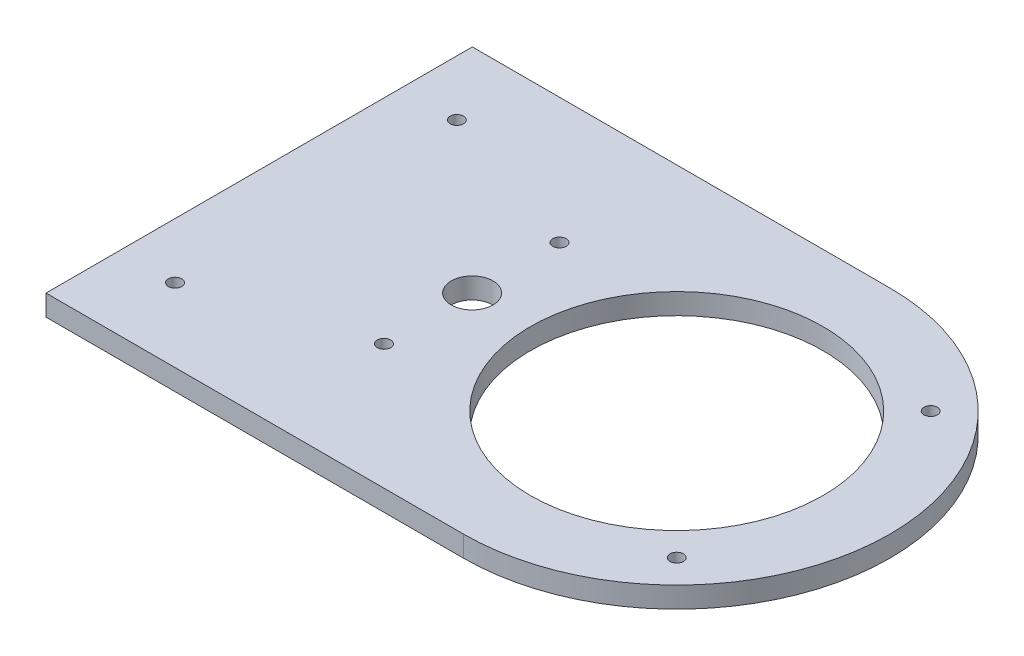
ISO-10303-21;
HEADER;
FILE_DESCRIPTION(('STEP AP214'),'2;1');
FILE_NAME('part.step','',(''),(''),'','','');
FILE_SCHEMA(('AUTOMOTIVE_DESIGN { 1 0 10303 214 1 1 1 1 }'));
ENDSEC;
DATA;
#1=APPLICATION_CONTEXT('core data for automotive mechanical design processes');
#2=APPLICATION_PROTOCOL_DEFINITION('international standard','automotive_design',2000,#1);
#3=PRODUCT_CONTEXT('',#1,'mechanical');
#4=PRODUCT('Part','Part','',(#3));
#5=PRODUCT_RELATED_PRODUCT_CATEGORY('part','',(#4));
#6=PRODUCT_DEFINITION_FORMATION('','',#4);
#7=PRODUCT_DEFINITION_CONTEXT('part definition',#1,'design');
#8=PRODUCT_DEFINITION('design','',#6,#7);
#9=PRODUCT_DEFINITION_SHAPE('','',#8);
#10=(LENGTH_UNIT() NAMED_UNIT(*) SI_UNIT(.MILLI.,.METRE.));
#11=(NAMED_UNIT(*) PLANE_ANGLE_UNIT() SI_UNIT($,.RADIAN.));
#12=(NAMED_UNIT(*) SI_UNIT($,.STERADIAN.) SOLID_ANGLE_UNIT());
#13=UNCERTAINTY_MEASURE_WITH_UNIT(LENGTH_MEASURE(1.E-05),#10,'distance_accuracy_value','');
#14=(GEOMETRIC_REPRESENTATION_CONTEXT(3) GLOBAL_UNCERTAINTY_ASSIGNED_CONTEXT((#13)) GLOBAL_UNIT_ASSIGNED_CONTEXT((#10,
#11,#12)) REPRESENTATION_CONTEXT('',''));
#15=CARTESIAN_POINT('',(0.,0.,0.));
#16=DIRECTION('',(0.,0.,1.));
#17=DIRECTION('',(1.,0.,0.));
#18=AXIS2_PLACEMENT_3D('',#15,#16,#17);
#19=CARTESIAN_POINT('',(-100.,5.,51.05));
#20=DIRECTION('',(0.,0.,-1.));
#21=DIRECTION('',(-1.,0.,0.));
#22=AXIS2_PLACEMENT_3D('',#19,#20,#21);
#23=PLANE('',#22);
#24=DIRECTION('',(0.,1.,0.));
#25=VECTOR('',#24,1.);
#26=CARTESIAN_POINT('',(0.,0.,51.05));
#27=LINE('',#26,#25);
#28=CARTESIAN_POINT('',(0.,0.,51.05));
#29=VERTEX_POINT('',#28);
#30=CARTESIAN_POINT('',(0.,5.,51.05));
#31=VERTEX_POINT('',#30);
#32=EDGE_CURVE('E152',#29,#31,#27,.T.);
#33=ORIENTED_EDGE('',*,*,#32,.T.);
#34=DIRECTION('',(1.,0.,0.));
#35=VECTOR('',#34,1.);
#36=CARTESIAN_POINT('',(-100.,5.,51.05));
#37=LINE('',#36,#35);
#38=CARTESIAN_POINT('',(-100.,5.,51.05));
#39=VERTEX_POINT('',#38);
#40=EDGE_CURVE('E92',#39,#31,#37,.T.);
#41=ORIENTED_EDGE('',*,*,#40,.F.);
#42=DIRECTION('',(0.,-1.,0.));
#43=VECTOR('',#42,1.);
#44=CARTESIAN_POINT('',(-100.,5.,51.05));
#45=LINE('',#44,#43);
#46=CARTESIAN_POINT('',(-100.,0.,51.05));
#47=VERTEX_POINT('',#46);
#48=EDGE_CURVE('E49',#39,#47,#45,.T.);
#49=ORIENTED_EDGE('',*,*,#48,.T.);
#50=DIRECTION('',(1.,0.,0.));
#51=VECTOR('',#50,1.);
#52=CARTESIAN_POINT('',(-100.,0.,51.05));
#53=LINE('',#52,#51);
#54=EDGE_CURVE('E86',#47,#29,#53,.T.);
#55=ORIENTED_EDGE('',*,*,#54,.T.);
#56=EDGE_LOOP('',(#33,#41,#49,#55));
#57=FACE_BOUND('',#56,.T.);
#58=ADVANCED_FACE('F40',(#57),#23,.F.);
#59=CARTESIAN_POINT('',(0.,5.,0.));
#60=DIRECTION('',(0.,-1.,0.));
#61=DIRECTION('',(0.,0.,-1.));
#62=AXIS2_PLACEMENT_3D('',#59,#60,#61);
#63=PLANE('',#62);
#64=CARTESIAN_POINT('',(-86.7,5.,-34.05));
#65=DIRECTION('',(0.,-1.,0.));
#66=DIRECTION('',(0.,0.,-1.));
#67=AXIS2_PLACEMENT_3D('',#64,#65,#66);
#68=CIRCLE('',#67,1.6);
#69=CARTESIAN_POINT('',(-86.7,5.,-35.65));
#70=VERTEX_POINT('',#69);
#71=EDGE_CURVE('E197',#70,#70,#68,.T.);
#72=ORIENTED_EDGE('',*,*,#71,.T.);
#73=EDGE_LOOP('',(#72));
#74=FACE_BOUND('',#73,.T.);
#75=CARTESIAN_POINT('',(-86.7,5.,33.45));
#76=DIRECTION('',(0.,-1.,0.));
#77=DIRECTION('',(0.,0.,-1.));
#78=AXIS2_PLACEMENT_3D('',#75,#76,#77);
#79=CIRCLE('',#78,1.6);
#80=CARTESIAN_POINT('',(-86.7,5.,31.85));
#81=VERTEX_POINT('',#80);
#82=EDGE_CURVE('E185',#81,#81,#79,.T.);
#83=ORIENTED_EDGE('',*,*,#82,.T.);
#84=EDGE_LOOP('',(#83));
#85=FACE_BOUND('',#84,.T.);
#86=CARTESIAN_POINT('',(-49.,5.,-20.91));
#87=DIRECTION('',(0.,-1.,0.));
#88=DIRECTION('',(0.,0.,-1.));
#89=AXIS2_PLACEMENT_3D('',#86,#87,#88);
#90=CIRCLE('',#89,1.6);
#91=CARTESIAN_POINT('',(-49.,5.,-22.51));
#92=VERTEX_POINT('',#91);
#93=EDGE_CURVE('E173',#92,#92,#90,.T.);
#94=ORIENTED_EDGE('',*,*,#93,.T.);
#95=EDGE_LOOP('',(#94));
#96=FACE_BOUND('',#95,.T.);
#97=CARTESIAN_POINT('',(-49.,5.,21.11));
#98=DIRECTION('',(0.,-1.,0.));
#99=DIRECTION('',(0.,0.,-1.));
#100=AXIS2_PLACEMENT_3D('',#97,#98,#99);
#101=CIRCLE('',#100,1.6);
#102=CARTESIAN_POINT('',(-49.,5.,19.51));
#103=VERTEX_POINT('',#102);
#104=EDGE_CURVE('E159',#103,#103,#101,.T.);
#105=ORIENTED_EDGE('',*,*,#104,.T.);
#106=EDGE_LOOP('',(#105));
#107=FACE_BOUND('',#106,.T.);
#108=CARTESIAN_POINT('',(30.4055915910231,5.,30.4055915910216));
#109=DIRECTION('',(0.,-1.,0.));
#110=DIRECTION('',(0.,0.,-1.));
#111=AXIS2_PLACEMENT_3D('',#108,#109,#110);
#112=CIRCLE('',#111,1.6);
#113=CARTESIAN_POINT('',(30.4055915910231,5.,28.8055915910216));
#114=VERTEX_POINT('',#113);
#115=EDGE_CURVE('E139',#114,#114,#112,.T.);
#116=ORIENTED_EDGE('',*,*,#115,.T.);
#117=EDGE_LOOP('',(#116));
#118=FACE_BOUND('',#117,.T.);
#119=CARTESIAN_POINT('',(30.4055915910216,5.,-30.4055915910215));
#120=DIRECTION('',(0.,-1.,0.));
#121=DIRECTION('',(0.,0.,-1.));
#122=AXIS2_PLACEMENT_3D('',#119,#120,#121);
#123=CIRCLE('',#122,1.6);
#124=CARTESIAN_POINT('',(30.4055915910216,5.,-32.0055915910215));
#125=VERTEX_POINT('',#124);
#126=EDGE_CURVE('E124',#125,#125,#123,.T.);
#127=ORIENTED_EDGE('',*,*,#126,.T.);
#128=EDGE_LOOP('',(#127));
#129=FACE_BOUND('',#128,.T.);
#130=ORIENTED_EDGE('',*,*,#40,.T.);
#131=CARTESIAN_POINT('',(0.,5.,0.));
#132=DIRECTION('',(0.,-1.,0.));
#133=DIRECTION('',(0.,0.,1.));
#134=AXIS2_PLACEMENT_3D('',#131,#132,#133);
#135=CIRCLE('',#134,51.05);
#136=CARTESIAN_POINT('',(0.,5.,-51.05));
#137=VERTEX_POINT('',#136);
#138=EDGE_CURVE('E56',#137,#31,#135,.T.);
#139=ORIENTED_EDGE('',*,*,#138,.F.);
#140=DIRECTION('',(-1.,0.,0.));
#141=VECTOR('',#140,1.);
#142=CARTESIAN_POINT('',(-100.,5.,-51.05));
#143=LINE('',#142,#141);
#144=CARTESIAN_POINT('',(-100.,5.,-51.05));
#145=VERTEX_POINT('',#144);
#146=EDGE_CURVE('E100',#137,#145,#143,.T.);
#147=ORIENTED_EDGE('',*,*,#146,.T.);
#148=DIRECTION('',(0.,0.,1.));
#149=VECTOR('',#148,1.);
#150=CARTESIAN_POINT('',(-100.,5.,51.05));
#151=LINE('',#150,#149);
#152=EDGE_CURVE('E65',#145,#39,#151,.T.);
#153=ORIENTED_EDGE('',*,*,#152,.T.);
#154=EDGE_LOOP('',(#130,#139,#147,#153));
#155=FACE_BOUND('',#154,.T.);
#156=CARTESIAN_POINT('',(0.,5.,0.));
#157=DIRECTION('',(0.,1.,0.));
#158=DIRECTION('',(0.,0.,1.));
#159=AXIS2_PLACEMENT_3D('',#156,#157,#158);
#160=CIRCLE('',#159,35.05);
#161=CARTESIAN_POINT('',(0.,5.,35.05));
#162=VERTEX_POINT('',#161);
#163=EDGE_CURVE('E107',#162,#162,#160,.T.);
#164=ORIENTED_EDGE('',*,*,#163,.F.);
#165=EDGE_LOOP('',(#164));
#166=FACE_BOUND('',#165,.T.);
#167=CARTESIAN_POINT('',(-49.,5.,0.));
#168=DIRECTION('',(0.,1.,0.));
#169=DIRECTION('',(0.,0.,1.));
#170=AXIS2_PLACEMENT_3D('',#167,#168,#169);
#171=CIRCLE('',#170,5.);
#172=CARTESIAN_POINT('',(-49.,5.,5.));
#173=VERTEX_POINT('',#172);
#174=EDGE_CURVE('E116',#173,#173,#171,.T.);
#175=ORIENTED_EDGE('',*,*,#174,.F.);
#176=EDGE_LOOP('',(#175));
#177=FACE_BOUND('',#176,.T.);
#178=ADVANCED_FACE('F214',(#74,#85,#96,#107,#118,#129,#155,#166,#177),#63,.F.);
#179=CARTESIAN_POINT('',(0.,0.,0.));
#180=DIRECTION('',(0.,-1.,0.));
#181=DIRECTION('',(0.,0.,-1.));
#182=AXIS2_PLACEMENT_3D('',#179,#180,#181);
#183=PLANE('',#182);
#184=CARTESIAN_POINT('',(-86.7,0.,-34.05));
#185=DIRECTION('',(0.,-1.,0.));
#186=DIRECTION('',(0.,0.,-1.));
#187=AXIS2_PLACEMENT_3D('',#184,#185,#186);
#188=CIRCLE('',#187,3.15);
#189=CARTESIAN_POINT('',(-86.7,0.,-37.2));
#190=VERTEX_POINT('',#189);
#191=EDGE_CURVE('E205',#190,#190,#188,.T.);
#192=ORIENTED_EDGE('',*,*,#191,.F.);
#193=EDGE_LOOP('',(#192));
#194=FACE_BOUND('',#193,.T.);
#195=CARTESIAN_POINT('',(-86.7,0.,33.45));
#196=DIRECTION('',(0.,-1.,0.));
#197=DIRECTION('',(0.,0.,-1.));
#198=AXIS2_PLACEMENT_3D('',#195,#196,#197);
#199=CIRCLE('',#198,3.15);
#200=CARTESIAN_POINT('',(-86.7,0.,30.3));
#201=VERTEX_POINT('',#200);
#202=EDGE_CURVE('E193',#201,#201,#199,.T.);
#203=ORIENTED_EDGE('',*,*,#202,.F.);
#204=EDGE_LOOP('',(#203));
#205=FACE_BOUND('',#204,.T.);
#206=CARTESIAN_POINT('',(-49.,0.,-20.91));
#207=DIRECTION('',(0.,-1.,0.));
#208=DIRECTION('',(0.,0.,-1.));
#209=AXIS2_PLACEMENT_3D('',#206,#207,#208);
#210=CIRCLE('',#209,3.15);
#211=CARTESIAN_POINT('',(-49.,0.,-24.06));
#212=VERTEX_POINT('',#211);
#213=EDGE_CURVE('E181',#212,#212,#210,.T.);
#214=ORIENTED_EDGE('',*,*,#213,.F.);
#215=EDGE_LOOP('',(#214));
#216=FACE_BOUND('',#215,.T.);
#217=CARTESIAN_POINT('',(-49.,0.,21.11));
#218=DIRECTION('',(0.,-1.,0.));
#219=DIRECTION('',(0.,0.,-1.));
#220=AXIS2_PLACEMENT_3D('',#217,#218,#219);
#221=CIRCLE('',#220,3.15);
#222=CARTESIAN_POINT('',(-49.,0.,17.96));
#223=VERTEX_POINT('',#222);
#224=EDGE_CURVE('E169',#223,#223,#221,.T.);
#225=ORIENTED_EDGE('',*,*,#224,.F.);
#226=EDGE_LOOP('',(#225));
#227=FACE_BOUND('',#226,.T.);
#228=CARTESIAN_POINT('',(0.,0.,0.));
#229=DIRECTION('',(0.,-1.,0.));
#230=DIRECTION('',(0.,0.,1.));
#231=AXIS2_PLACEMENT_3D('',#228,#229,#230);
#232=CIRCLE('',#231,51.05);
#233=CARTESIAN_POINT('',(0.,0.,-51.05));
#234=VERTEX_POINT('',#233);
#235=EDGE_CURVE('E98',#234,#29,#232,.T.);
#236=ORIENTED_EDGE('',*,*,#235,.T.);
#237=ORIENTED_EDGE('',*,*,#54,.F.);
#238=DIRECTION('',(0.,0.,1.));
#239=VECTOR('',#238,1.);
#240=CARTESIAN_POINT('',(-100.,0.,51.05));
#241=LINE('',#240,#239);
#242=CARTESIAN_POINT('',(-100.,0.,-51.05));
#243=VERTEX_POINT('',#242);
#244=EDGE_CURVE('E77',#243,#47,#241,.T.);
#245=ORIENTED_EDGE('',*,*,#244,.F.);
#246=DIRECTION('',(-1.,0.,0.));
#247=VECTOR('',#246,1.);
#248=CARTESIAN_POINT('',(-100.,0.,-51.05));
#249=LINE('',#248,#247);
#250=EDGE_CURVE('E87',#234,#243,#249,.T.);
#251=ORIENTED_EDGE('',*,*,#250,.F.);
#252=EDGE_LOOP('',(#236,#237,#245,#251));
#253=FACE_BOUND('',#252,.T.);
#254=CARTESIAN_POINT('',(30.4055915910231,0.,30.4055915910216));
#255=DIRECTION('',(0.,-1.,0.));
#256=DIRECTION('',(0.,0.,-1.));
#257=AXIS2_PLACEMENT_3D('',#254,#255,#256);
#258=CIRCLE('',#257,3.15);
#259=CARTESIAN_POINT('',(30.4055915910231,0.,27.2555915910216));
#260=VERTEX_POINT('',#259);
#261=EDGE_CURVE('E147',#260,#260,#258,.T.);
#262=ORIENTED_EDGE('',*,*,#261,.F.);
#263=EDGE_LOOP('',(#262));
#264=FACE_BOUND('',#263,.T.);
#265=CARTESIAN_POINT('',(30.4055915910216,0.,-30.4055915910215));
#266=DIRECTION('',(0.,-1.,0.));
#267=DIRECTION('',(0.,0.,-1.));
#268=AXIS2_PLACEMENT_3D('',#265,#266,#267);
#269=CIRCLE('',#268,3.15);
#270=CARTESIAN_POINT('',(30.4055915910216,0.,-33.5555915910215));
#271=VERTEX_POINT('',#270);
#272=EDGE_CURVE('E135',#271,#271,#269,.T.);
#273=ORIENTED_EDGE('',*,*,#272,.F.);
#274=EDGE_LOOP('',(#273));
#275=FACE_BOUND('',#274,.T.);
#276=CARTESIAN_POINT('',(0.,0.,0.));
#277=DIRECTION('',(0.,1.,0.));
#278=DIRECTION('',(0.,0.,1.));
#279=AXIS2_PLACEMENT_3D('',#276,#277,#278);
#280=CIRCLE('',#279,35.05);
#281=CARTESIAN_POINT('',(0.,0.,35.05));
#282=VERTEX_POINT('',#281);
#283=EDGE_CURVE('E112',#282,#282,#280,.T.);
#284=ORIENTED_EDGE('',*,*,#283,.T.);
#285=EDGE_LOOP('',(#284));
#286=FACE_BOUND('',#285,.T.);
#287=CARTESIAN_POINT('',(-49.,0.,0.));
#288=DIRECTION('',(0.,1.,0.));
#289=DIRECTION('',(0.,0.,1.));
#290=AXIS2_PLACEMENT_3D('',#287,#288,#289);
#291=CIRCLE('',#290,5.);
#292=CARTESIAN_POINT('',(-49.,0.,5.));
#293=VERTEX_POINT('',#292);
#294=EDGE_CURVE('E120',#293,#293,#291,.T.);
#295=ORIENTED_EDGE('',*,*,#294,.T.);
#296=EDGE_LOOP('',(#295));
#297=FACE_BOUND('',#296,.T.);
#298=ADVANCED_FACE('F95',(#194,#205,#216,#227,#253,#264,#275,#286,#297),#183,.T.);
#299=CARTESIAN_POINT('',(-100.,5.,-51.05));
#300=DIRECTION('',(0.,0.,1.));
#301=DIRECTION('',(1.,0.,0.));
#302=AXIS2_PLACEMENT_3D('',#299,#300,#301);
#303=PLANE('',#302);
#304=ORIENTED_EDGE('',*,*,#146,.F.);
#305=DIRECTION('',(0.,1.,0.));
#306=VECTOR('',#305,1.);
#307=CARTESIAN_POINT('',(0.,0.,-51.05));
#308=LINE('',#307,#306);
#309=EDGE_CURVE('E151',#234,#137,#308,.T.);
#310=ORIENTED_EDGE('',*,*,#309,.F.);
#311=ORIENTED_EDGE('',*,*,#250,.T.);
#312=DIRECTION('',(0.,-1.,0.));
#313=VECTOR('',#312,1.);
#314=CARTESIAN_POINT('',(-100.,5.,-51.05));
#315=LINE('',#314,#313);
#316=EDGE_CURVE('E11',#145,#243,#315,.T.);
#317=ORIENTED_EDGE('',*,*,#316,.F.);
#318=EDGE_LOOP('',(#304,#310,#311,#317));
#319=FACE_BOUND('',#318,.T.);
#320=ADVANCED_FACE('F42',(#319),#303,.F.);
#321=CARTESIAN_POINT('',(-100.,5.,51.05));
#322=DIRECTION('',(1.,0.,0.));
#323=DIRECTION('',(0.,0.,-1.));
#324=AXIS2_PLACEMENT_3D('',#321,#322,#323);
#325=PLANE('',#324);
#326=ORIENTED_EDGE('',*,*,#244,.T.);
#327=ORIENTED_EDGE('',*,*,#48,.F.);
#328=ORIENTED_EDGE('',*,*,#152,.F.);
#329=ORIENTED_EDGE('',*,*,#316,.T.);
#330=EDGE_LOOP('',(#326,#327,#328,#329));
#331=FACE_BOUND('',#330,.T.);
#332=ADVANCED_FACE('F79',(#331),#325,.F.);
#333=CARTESIAN_POINT('',(0.,5.,0.));
#334=DIRECTION('',(0.,-1.,0.));
#335=DIRECTION('',(0.,0.,-1.));
#336=AXIS2_PLACEMENT_3D('',#333,#334,#335);
#337=CYLINDRICAL_SURFACE('',#336,35.05);
#338=ORIENTED_EDGE('',*,*,#163,.T.);
#339=EDGE_LOOP('',(#338));
#340=FACE_BOUND('',#339,.T.);
#341=ORIENTED_EDGE('',*,*,#283,.F.);
#342=EDGE_LOOP('',(#341));
#343=FACE_BOUND('',#342,.T.);
#344=ADVANCED_FACE('F247',(#340,#343),#337,.F.);
#345=CARTESIAN_POINT('',(-49.,5.,0.));
#346=DIRECTION('',(0.,-1.,0.));
#347=DIRECTION('',(0.,0.,-1.));
#348=AXIS2_PLACEMENT_3D('',#345,#346,#347);
#349=CYLINDRICAL_SURFACE('',#348,5.);
#350=ORIENTED_EDGE('',*,*,#174,.T.);
#351=EDGE_LOOP('',(#350));
#352=FACE_BOUND('',#351,.T.);
#353=ORIENTED_EDGE('',*,*,#294,.F.);
#354=EDGE_LOOP('',(#353));
#355=FACE_BOUND('',#354,.T.);
#356=ADVANCED_FACE('F252',(#352,#355),#349,.F.);
#357=CARTESIAN_POINT('',(30.4055915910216,0.,-30.4055915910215));
#358=DIRECTION('',(0.,-1.,0.));
#359=DIRECTION('',(0.,0.,-1.));
#360=AXIS2_PLACEMENT_3D('',#357,#358,#359);
#361=CYLINDRICAL_SURFACE('',#360,1.6);
#362=ORIENTED_EDGE('',*,*,#126,.F.);
#363=EDGE_LOOP('',(#362));
#364=FACE_BOUND('',#363,.T.);
#365=CARTESIAN_POINT('',(30.4055915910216,1.55,-30.4055915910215));
#366=DIRECTION('',(0.,-1.,0.));
#367=DIRECTION('',(0.,0.,-1.));
#368=AXIS2_PLACEMENT_3D('',#365,#366,#367);
#369=CIRCLE('',#368,1.6);
#370=CARTESIAN_POINT('',(30.4055915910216,1.55,-32.0055915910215));
#371=VERTEX_POINT('',#370);
#372=EDGE_CURVE('E131',#371,#371,#369,.T.);
#373=ORIENTED_EDGE('',*,*,#372,.T.);
#374=EDGE_LOOP('',(#373));
#375=FACE_BOUND('',#374,.T.);
#376=ADVANCED_FACE('F268',(#364,#375),#361,.F.);
#377=CARTESIAN_POINT('',(30.4055915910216,0.,-30.4055915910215));
#378=DIRECTION('',(0.,-1.,0.));
#379=DIRECTION('',(0.,0.,-1.));
#380=AXIS2_PLACEMENT_3D('',#377,#378,#379);
#381=CONICAL_SURFACE('',#380,3.15,0.785398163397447);
#382=ORIENTED_EDGE('',*,*,#372,.F.);
#383=EDGE_LOOP('',(#382));
#384=FACE_BOUND('',#383,.T.);
#385=ORIENTED_EDGE('',*,*,#272,.T.);
#386=EDGE_LOOP('',(#385));
#387=FACE_BOUND('',#386,.T.);
#388=ADVANCED_FACE('F275',(#384,#387),#381,.F.);
#389=CARTESIAN_POINT('',(30.4055915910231,0.,30.4055915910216));
#390=DIRECTION('',(0.,-1.,0.));
#391=DIRECTION('',(0.,0.,-1.));
#392=AXIS2_PLACEMENT_3D('',#389,#390,#391);
#393=CYLINDRICAL_SURFACE('',#392,1.6);
#394=ORIENTED_EDGE('',*,*,#115,.F.);
#395=EDGE_LOOP('',(#394));
#396=FACE_BOUND('',#395,.T.);
#397=CARTESIAN_POINT('',(30.4055915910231,1.55,30.4055915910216));
#398=DIRECTION('',(0.,-1.,0.));
#399=DIRECTION('',(0.,0.,-1.));
#400=AXIS2_PLACEMENT_3D('',#397,#398,#399);
#401=CIRCLE('',#400,1.6);
#402=CARTESIAN_POINT('',(30.4055915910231,1.55,28.8055915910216));
#403=VERTEX_POINT('',#402);
#404=EDGE_CURVE('E143',#403,#403,#401,.T.);
#405=ORIENTED_EDGE('',*,*,#404,.T.);
#406=EDGE_LOOP('',(#405));
#407=FACE_BOUND('',#406,.T.);
#408=ADVANCED_FACE('F281',(#396,#407),#393,.F.);
#409=CARTESIAN_POINT('',(30.4055915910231,0.,30.4055915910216));
#410=DIRECTION('',(0.,-1.,0.));
#411=DIRECTION('',(0.,0.,-1.));
#412=AXIS2_PLACEMENT_3D('',#409,#410,#411);
#413=CONICAL_SURFACE('',#412,3.15,0.785398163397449);
#414=ORIENTED_EDGE('',*,*,#404,.F.);
#415=EDGE_LOOP('',(#414));
#416=FACE_BOUND('',#415,.T.);
#417=ORIENTED_EDGE('',*,*,#261,.T.);
#418=EDGE_LOOP('',(#417));
#419=FACE_BOUND('',#418,.T.);
#420=ADVANCED_FACE('F285',(#416,#419),#413,.F.);
#421=CARTESIAN_POINT('',(0.,0.,0.));
#422=DIRECTION('',(0.,1.,0.));
#423=DIRECTION('',(0.,0.,1.));
#424=AXIS2_PLACEMENT_3D('',#421,#422,#423);
#425=CYLINDRICAL_SURFACE('',#424,51.05);
#426=ORIENTED_EDGE('',*,*,#138,.T.);
#427=ORIENTED_EDGE('',*,*,#32,.F.);
#428=ORIENTED_EDGE('',*,*,#235,.F.);
#429=ORIENTED_EDGE('',*,*,#309,.T.);
#430=EDGE_LOOP('',(#426,#427,#428,#429));
#431=FACE_BOUND('',#430,.T.);
#432=ADVANCED_FACE('F235',(#431),#425,.T.);
#433=CARTESIAN_POINT('',(-49.,0.,21.11));
#434=DIRECTION('',(0.,-1.,0.));
#435=DIRECTION('',(0.,0.,-1.));
#436=AXIS2_PLACEMENT_3D('',#433,#434,#435);
#437=CYLINDRICAL_SURFACE('',#436,1.6);
#438=ORIENTED_EDGE('',*,*,#104,.F.);
#439=EDGE_LOOP('',(#438));
#440=FACE_BOUND('',#439,.T.);
#441=CARTESIAN_POINT('',(-49.,1.55,21.11));
#442=DIRECTION('',(0.,-1.,0.));
#443=DIRECTION('',(0.,0.,-1.));
#444=AXIS2_PLACEMENT_3D('',#441,#442,#443);
#445=CIRCLE('',#444,1.6);
#446=CARTESIAN_POINT('',(-49.,1.55,19.51));
#447=VERTEX_POINT('',#446);
#448=EDGE_CURVE('E165',#447,#447,#445,.T.);
#449=ORIENTED_EDGE('',*,*,#448,.T.);
#450=EDGE_LOOP('',(#449));
#451=FACE_BOUND('',#450,.T.);
#452=ADVANCED_FACE('F225',(#440,#451),#437,.F.);
#453=CARTESIAN_POINT('',(-49.,0.,21.11));
#454=DIRECTION('',(0.,-1.,0.));
#455=DIRECTION('',(0.,0.,-1.));
#456=AXIS2_PLACEMENT_3D('',#453,#454,#455);
#457=CONICAL_SURFACE('',#456,3.15,0.785398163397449);
#458=ORIENTED_EDGE('',*,*,#448,.F.);
#459=EDGE_LOOP('',(#458));
#460=FACE_BOUND('',#459,.T.);
#461=ORIENTED_EDGE('',*,*,#224,.T.);
#462=EDGE_LOOP('',(#461));
#463=FACE_BOUND('',#462,.T.);
#464=ADVANCED_FACE('F222',(#460,#463),#457,.F.);
#465=CARTESIAN_POINT('',(-49.,0.,-20.91));
#466=DIRECTION('',(0.,-1.,0.));
#467=DIRECTION('',(0.,0.,-1.));
#468=AXIS2_PLACEMENT_3D('',#465,#466,#467);
#469=CYLINDRICAL_SURFACE('',#468,1.6);
#470=ORIENTED_EDGE('',*,*,#93,.F.);
#471=EDGE_LOOP('',(#470));
#472=FACE_BOUND('',#471,.T.);
#473=CARTESIAN_POINT('',(-49.,1.55,-20.91));
#474=DIRECTION('',(0.,-1.,0.));
#475=DIRECTION('',(0.,0.,-1.));
#476=AXIS2_PLACEMENT_3D('',#473,#474,#475);
#477=CIRCLE('',#476,1.6);
#478=CARTESIAN_POINT('',(-49.,1.55,-22.51));
#479=VERTEX_POINT('',#478);
#480=EDGE_CURVE('E177',#479,#479,#477,.T.);
#481=ORIENTED_EDGE('',*,*,#480,.T.);
#482=EDGE_LOOP('',(#481));
#483=FACE_BOUND('',#482,.T.);
#484=ADVANCED_FACE('F224',(#472,#483),#469,.F.);
#485=CARTESIAN_POINT('',(-49.,0.,-20.91));
#486=DIRECTION('',(0.,-1.,0.));
#487=DIRECTION('',(0.,0.,-1.));
#488=AXIS2_PLACEMENT_3D('',#485,#486,#487);
#489=CONICAL_SURFACE('',#488,3.15,0.785398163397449);
#490=ORIENTED_EDGE('',*,*,#480,.F.);
#491=EDGE_LOOP('',(#490));
#492=FACE_BOUND('',#491,.T.);
#493=ORIENTED_EDGE('',*,*,#213,.T.);
#494=EDGE_LOOP('',(#493));
#495=FACE_BOUND('',#494,.T.);
#496=ADVANCED_FACE('F232',(#492,#495),#489,.F.);
#497=CARTESIAN_POINT('',(-86.7,0.,33.45));
#498=DIRECTION('',(0.,-1.,0.));
#499=DIRECTION('',(0.,0.,-1.));
#500=AXIS2_PLACEMENT_3D('',#497,#498,#499);
#501=CYLINDRICAL_SURFACE('',#500,1.6);
#502=ORIENTED_EDGE('',*,*,#82,.F.);
#503=EDGE_LOOP('',(#502));
#504=FACE_BOUND('',#503,.T.);
#505=CARTESIAN_POINT('',(-86.7,1.55,33.45));
#506=DIRECTION('',(0.,-1.,0.));
#507=DIRECTION('',(0.,0.,-1.));
#508=AXIS2_PLACEMENT_3D('',#505,#506,#507);
#509=CIRCLE('',#508,1.6);
#510=CARTESIAN_POINT('',(-86.7,1.55,31.85));
#511=VERTEX_POINT('',#510);
#512=EDGE_CURVE('E189',#511,#511,#509,.T.);
#513=ORIENTED_EDGE('',*,*,#512,.T.);
#514=EDGE_LOOP('',(#513));
#515=FACE_BOUND('',#514,.T.);
#516=ADVANCED_FACE('F318',(#504,#515),#501,.F.);
#517=CARTESIAN_POINT('',(-86.7,0.,33.45));
#518=DIRECTION('',(0.,-1.,0.));
#519=DIRECTION('',(0.,0.,-1.));
#520=AXIS2_PLACEMENT_3D('',#517,#518,#519);
#521=CONICAL_SURFACE('',#520,3.15,0.785398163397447);
#522=ORIENTED_EDGE('',*,*,#512,.F.);
#523=EDGE_LOOP('',(#522));
#524=FACE_BOUND('',#523,.T.);
#525=ORIENTED_EDGE('',*,*,#202,.T.);
#526=EDGE_LOOP('',(#525));
#527=FACE_BOUND('',#526,.T.);
#528=ADVANCED_FACE('F341',(#524,#527),#521,.F.);
#529=CARTESIAN_POINT('',(-86.7,0.,-34.05));
#530=DIRECTION('',(0.,-1.,0.));
#531=DIRECTION('',(0.,0.,-1.));
#532=AXIS2_PLACEMENT_3D('',#529,#530,#531);
#533=CYLINDRICAL_SURFACE('',#532,1.6);
#534=ORIENTED_EDGE('',*,*,#71,.F.);
#535=EDGE_LOOP('',(#534));
#536=FACE_BOUND('',#535,.T.);
#537=CARTESIAN_POINT('',(-86.7,1.55,-34.05));
#538=DIRECTION('',(0.,-1.,0.));
#539=DIRECTION('',(0.,0.,-1.));
#540=AXIS2_PLACEMENT_3D('',#537,#538,#539);
#541=CIRCLE('',#540,1.6);
#542=CARTESIAN_POINT('',(-86.7,1.55,-35.65));
#543=VERTEX_POINT('',#542);
#544=EDGE_CURVE('E201',#543,#543,#541,.T.);
#545=ORIENTED_EDGE('',*,*,#544,.T.);
#546=EDGE_LOOP('',(#545));
#547=FACE_BOUND('',#546,.T.);
#548=ADVANCED_FACE('F351',(#536,#547),#533,.F.);
#549=CARTESIAN_POINT('',(-86.7,0.,-34.05));
#550=DIRECTION('',(0.,-1.,0.));
#551=DIRECTION('',(0.,0.,-1.));
#552=AXIS2_PLACEMENT_3D('',#549,#550,#551);
#553=CONICAL_SURFACE('',#552,3.15,0.785398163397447);
#554=ORIENTED_EDGE('',*,*,#544,.F.);
#555=EDGE_LOOP('',(#554));
#556=FACE_BOUND('',#555,.T.);
#557=ORIENTED_EDGE('',*,*,#191,.T.);
#558=EDGE_LOOP('',(#557));
#559=FACE_BOUND('',#558,.T.);
#560=ADVANCED_FACE('F210',(#556,#559),#553,.F.);
#561=CLOSED_SHELL('',(#58,#178,#298,#320,#332,#344,#356,#376,#388,#408,#420,#432,#452,#464,#484,
#496,#516,#528,#548,#560));
#562=MANIFOLD_SOLID_BREP('B2',#561);
#563=ADVANCED_BREP_SHAPE_REPRESENTATION('',(#18,#562),#14);
#564=SHAPE_DEFINITION_REPRESENTATION(#9,#563);
ENDSEC;
END-ISO-10303-21;
